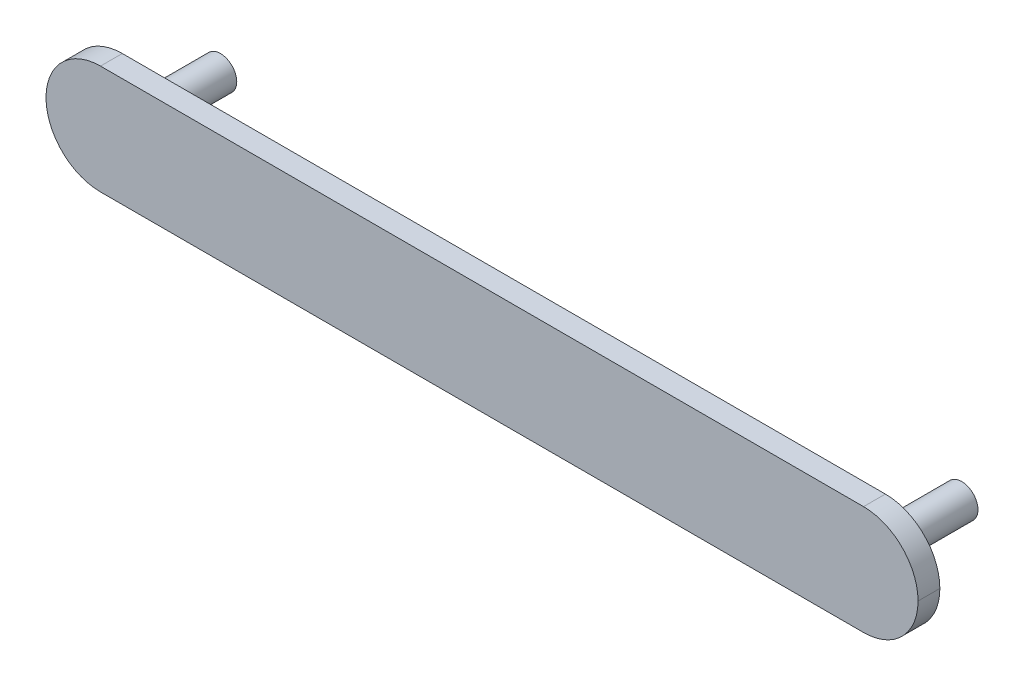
ISO-10303-21;
HEADER;
FILE_DESCRIPTION(('STEP AP214'),'2;1');
FILE_NAME('part.step','',(''),(''),'','','');
FILE_SCHEMA(('AUTOMOTIVE_DESIGN { 1 0 10303 214 1 1 1 1 }'));
ENDSEC;
DATA;
#1=APPLICATION_CONTEXT('core data for automotive mechanical design processes');
#2=APPLICATION_PROTOCOL_DEFINITION('international standard','automotive_design',2000,#1);
#3=PRODUCT_CONTEXT('',#1,'mechanical');
#4=PRODUCT('Part','Part','',(#3));
#5=PRODUCT_RELATED_PRODUCT_CATEGORY('part','',(#4));
#6=PRODUCT_DEFINITION_FORMATION('','',#4);
#7=PRODUCT_DEFINITION_CONTEXT('part definition',#1,'design');
#8=PRODUCT_DEFINITION('design','',#6,#7);
#9=PRODUCT_DEFINITION_SHAPE('','',#8);
#10=(LENGTH_UNIT() NAMED_UNIT(*) SI_UNIT(.MILLI.,.METRE.));
#11=(NAMED_UNIT(*) PLANE_ANGLE_UNIT() SI_UNIT($,.RADIAN.));
#12=(NAMED_UNIT(*) SI_UNIT($,.STERADIAN.) SOLID_ANGLE_UNIT());
#13=UNCERTAINTY_MEASURE_WITH_UNIT(LENGTH_MEASURE(1.E-05),#10,'distance_accuracy_value','');
#14=(GEOMETRIC_REPRESENTATION_CONTEXT(3) GLOBAL_UNCERTAINTY_ASSIGNED_CONTEXT((#13)) GLOBAL_UNIT_ASSIGNED_CONTEXT((#10,
#11,#12)) REPRESENTATION_CONTEXT('',''));
#15=CARTESIAN_POINT('',(0.,0.,0.));
#16=DIRECTION('',(0.,0.,1.));
#17=DIRECTION('',(1.,0.,0.));
#18=AXIS2_PLACEMENT_3D('',#15,#16,#17);
#19=CARTESIAN_POINT('',(0.,-5.,2.));
#20=DIRECTION('',(0.,-1.,0.));
#21=DIRECTION('',(1.,0.,0.));
#22=AXIS2_PLACEMENT_3D('',#19,#20,#21);
#23=PLANE('',#22);
#24=DIRECTION('',(-1.,0.,0.));
#25=VECTOR('',#24,1.);
#26=CARTESIAN_POINT('',(0.,-5.,2.));
#27=LINE('',#26,#25);
#28=CARTESIAN_POINT('',(35.,-5.,2.));
#29=VERTEX_POINT('',#28);
#30=CARTESIAN_POINT('',(-35.,-5.,2.));
#31=VERTEX_POINT('',#30);
#32=EDGE_CURVE('E147',#29,#31,#27,.T.);
#33=ORIENTED_EDGE('',*,*,#32,.T.);
#34=DIRECTION('',(0.,0.,-1.));
#35=VECTOR('',#34,1.);
#36=CARTESIAN_POINT('',(-35.,-5.,2.));
#37=LINE('',#36,#35);
#38=CARTESIAN_POINT('',(-35.,-5.,0.));
#39=VERTEX_POINT('',#38);
#40=EDGE_CURVE('E11',#31,#39,#37,.T.);
#41=ORIENTED_EDGE('',*,*,#40,.T.);
#42=DIRECTION('',(-1.,0.,0.));
#43=VECTOR('',#42,1.);
#44=CARTESIAN_POINT('',(0.,-5.,0.));
#45=LINE('',#44,#43);
#46=CARTESIAN_POINT('',(35.,-5.,0.));
#47=VERTEX_POINT('',#46);
#48=EDGE_CURVE('E108',#47,#39,#45,.T.);
#49=ORIENTED_EDGE('',*,*,#48,.F.);
#50=DIRECTION('',(0.,0.,-1.));
#51=VECTOR('',#50,1.);
#52=CARTESIAN_POINT('',(35.,-5.,2.));
#53=LINE('',#52,#51);
#54=EDGE_CURVE('E55',#47,#29,#53,.F.);
#55=ORIENTED_EDGE('',*,*,#54,.T.);
#56=EDGE_LOOP('',(#33,#41,#49,#55));
#57=FACE_BOUND('',#56,.T.);
#58=ADVANCED_FACE('F45',(#57),#23,.T.);
#59=CARTESIAN_POINT('',(0.,5.,2.));
#60=DIRECTION('',(0.,-1.,0.));
#61=DIRECTION('',(0.,0.,-1.));
#62=AXIS2_PLACEMENT_3D('',#59,#60,#61);
#63=PLANE('',#62);
#64=DIRECTION('',(-1.,0.,0.));
#65=VECTOR('',#64,1.);
#66=CARTESIAN_POINT('',(0.,5.,0.));
#67=LINE('',#66,#65);
#68=CARTESIAN_POINT('',(35.,5.,0.));
#69=VERTEX_POINT('',#68);
#70=CARTESIAN_POINT('',(-35.,5.,0.));
#71=VERTEX_POINT('',#70);
#72=EDGE_CURVE('E154',#69,#71,#67,.T.);
#73=ORIENTED_EDGE('',*,*,#72,.T.);
#74=DIRECTION('',(0.,0.,-1.));
#75=VECTOR('',#74,1.);
#76=CARTESIAN_POINT('',(-35.,5.,2.));
#77=LINE('',#76,#75);
#78=CARTESIAN_POINT('',(-35.,5.,2.));
#79=VERTEX_POINT('',#78);
#80=EDGE_CURVE('E123',#71,#79,#77,.F.);
#81=ORIENTED_EDGE('',*,*,#80,.T.);
#82=DIRECTION('',(-1.,0.,0.));
#83=VECTOR('',#82,1.);
#84=CARTESIAN_POINT('',(0.,5.,2.));
#85=LINE('',#84,#83);
#86=CARTESIAN_POINT('',(35.,5.,2.));
#87=VERTEX_POINT('',#86);
#88=EDGE_CURVE('E153',#87,#79,#85,.T.);
#89=ORIENTED_EDGE('',*,*,#88,.F.);
#90=DIRECTION('',(0.,0.,-1.));
#91=VECTOR('',#90,1.);
#92=CARTESIAN_POINT('',(35.,5.,2.));
#93=LINE('',#92,#91);
#94=EDGE_CURVE('E125',#87,#69,#93,.T.);
#95=ORIENTED_EDGE('',*,*,#94,.T.);
#96=EDGE_LOOP('',(#73,#81,#89,#95));
#97=FACE_BOUND('',#96,.T.);
#98=ADVANCED_FACE('F165',(#97),#63,.F.);
#99=CARTESIAN_POINT('',(0.,0.,2.));
#100=DIRECTION('',(0.,0.,1.));
#101=DIRECTION('',(1.,0.,0.));
#102=AXIS2_PLACEMENT_3D('',#99,#100,#101);
#103=PLANE('',#102);
#104=ORIENTED_EDGE('',*,*,#88,.T.);
#105=CARTESIAN_POINT('',(-35.,0.,2.));
#106=DIRECTION('',(0.,0.,1.));
#107=DIRECTION('',(1.,0.,0.));
#108=AXIS2_PLACEMENT_3D('',#105,#106,#107);
#109=CIRCLE('',#108,5.);
#110=CARTESIAN_POINT('',(-40.,0.,2.));
#111=VERTEX_POINT('',#110);
#112=EDGE_CURVE('E141',#79,#111,#109,.T.);
#113=ORIENTED_EDGE('',*,*,#112,.T.);
#114=CARTESIAN_POINT('',(-35.,0.,2.));
#115=DIRECTION('',(0.,0.,1.));
#116=DIRECTION('',(1.,0.,0.));
#117=AXIS2_PLACEMENT_3D('',#114,#115,#116);
#118=CIRCLE('',#117,5.);
#119=EDGE_CURVE('E69',#111,#31,#118,.T.);
#120=ORIENTED_EDGE('',*,*,#119,.T.);
#121=ORIENTED_EDGE('',*,*,#32,.F.);
#122=CARTESIAN_POINT('',(35.,0.,2.));
#123=DIRECTION('',(0.,0.,1.));
#124=DIRECTION('',(1.,0.,0.));
#125=AXIS2_PLACEMENT_3D('',#122,#123,#124);
#126=CIRCLE('',#125,5.);
#127=CARTESIAN_POINT('',(40.,0.,2.));
#128=VERTEX_POINT('',#127);
#129=EDGE_CURVE('E63',#29,#128,#126,.T.);
#130=ORIENTED_EDGE('',*,*,#129,.T.);
#131=CARTESIAN_POINT('',(35.,0.,2.));
#132=DIRECTION('',(0.,0.,1.));
#133=DIRECTION('',(1.,0.,0.));
#134=AXIS2_PLACEMENT_3D('',#131,#132,#133);
#135=CIRCLE('',#134,5.);
#136=EDGE_CURVE('E136',#128,#87,#135,.T.);
#137=ORIENTED_EDGE('',*,*,#136,.T.);
#138=EDGE_LOOP('',(#104,#113,#120,#121,#130,#137));
#139=FACE_BOUND('',#138,.T.);
#140=ADVANCED_FACE('F151',(#139),#103,.T.);
#141=CARTESIAN_POINT('',(0.,0.,0.));
#142=DIRECTION('',(0.,0.,1.));
#143=DIRECTION('',(1.,0.,0.));
#144=AXIS2_PLACEMENT_3D('',#141,#142,#143);
#145=PLANE('',#144);
#146=CARTESIAN_POINT('',(-34.,0.,0.));
#147=DIRECTION('',(0.,0.,1.));
#148=DIRECTION('',(1.,0.,0.));
#149=AXIS2_PLACEMENT_3D('',#146,#147,#148);
#150=CIRCLE('',#149,1.5);
#151=CARTESIAN_POINT('',(-32.5,0.,0.));
#152=VERTEX_POINT('',#151);
#153=EDGE_CURVE('E180',#152,#152,#150,.T.);
#154=ORIENTED_EDGE('',*,*,#153,.T.);
#155=EDGE_LOOP('',(#154));
#156=FACE_BOUND('',#155,.T.);
#157=CARTESIAN_POINT('',(34.,0.,0.));
#158=DIRECTION('',(0.,0.,1.));
#159=DIRECTION('',(1.,0.,0.));
#160=AXIS2_PLACEMENT_3D('',#157,#158,#159);
#161=CIRCLE('',#160,1.5);
#162=CARTESIAN_POINT('',(35.5,0.,0.));
#163=VERTEX_POINT('',#162);
#164=EDGE_CURVE('E184',#163,#163,#161,.T.);
#165=ORIENTED_EDGE('',*,*,#164,.T.);
#166=EDGE_LOOP('',(#165));
#167=FACE_BOUND('',#166,.T.);
#168=CARTESIAN_POINT('',(-35.,0.,0.));
#169=DIRECTION('',(0.,0.,1.));
#170=DIRECTION('',(1.,0.,0.));
#171=AXIS2_PLACEMENT_3D('',#168,#169,#170);
#172=CIRCLE('',#171,5.);
#173=CARTESIAN_POINT('',(-40.,0.,0.));
#174=VERTEX_POINT('',#173);
#175=EDGE_CURVE('E100',#39,#174,#172,.F.);
#176=ORIENTED_EDGE('',*,*,#175,.T.);
#177=CARTESIAN_POINT('',(-35.,0.,0.));
#178=DIRECTION('',(0.,0.,1.));
#179=DIRECTION('',(1.,0.,0.));
#180=AXIS2_PLACEMENT_3D('',#177,#178,#179);
#181=CIRCLE('',#180,5.);
#182=EDGE_CURVE('E105',#174,#71,#181,.F.);
#183=ORIENTED_EDGE('',*,*,#182,.T.);
#184=ORIENTED_EDGE('',*,*,#72,.F.);
#185=CARTESIAN_POINT('',(35.,0.,0.));
#186=DIRECTION('',(0.,0.,1.));
#187=DIRECTION('',(1.,0.,0.));
#188=AXIS2_PLACEMENT_3D('',#185,#186,#187);
#189=CIRCLE('',#188,5.);
#190=CARTESIAN_POINT('',(40.,0.,0.));
#191=VERTEX_POINT('',#190);
#192=EDGE_CURVE('E112',#69,#191,#189,.F.);
#193=ORIENTED_EDGE('',*,*,#192,.T.);
#194=CARTESIAN_POINT('',(35.,0.,0.));
#195=DIRECTION('',(0.,0.,1.));
#196=DIRECTION('',(1.,0.,0.));
#197=AXIS2_PLACEMENT_3D('',#194,#195,#196);
#198=CIRCLE('',#197,5.);
#199=EDGE_CURVE('E158',#191,#47,#198,.F.);
#200=ORIENTED_EDGE('',*,*,#199,.T.);
#201=ORIENTED_EDGE('',*,*,#48,.T.);
#202=EDGE_LOOP('',(#176,#183,#184,#193,#200,#201));
#203=FACE_BOUND('',#202,.T.);
#204=ADVANCED_FACE('F102',(#156,#167,#203),#145,.F.);
#205=CARTESIAN_POINT('',(34.,0.,-8.));
#206=DIRECTION('',(0.,0.,1.));
#207=DIRECTION('',(1.,0.,0.));
#208=AXIS2_PLACEMENT_3D('',#205,#206,#207);
#209=CYLINDRICAL_SURFACE('',#208,1.5);
#210=CARTESIAN_POINT('',(34.,0.,-8.));
#211=DIRECTION('',(0.,0.,1.));
#212=DIRECTION('',(1.,0.,0.));
#213=AXIS2_PLACEMENT_3D('',#210,#211,#212);
#214=CIRCLE('',#213,1.5);
#215=CARTESIAN_POINT('',(35.5,0.,-8.));
#216=VERTEX_POINT('',#215);
#217=EDGE_CURVE('E119',#216,#216,#214,.T.);
#218=ORIENTED_EDGE('',*,*,#217,.T.);
#219=EDGE_LOOP('',(#218));
#220=FACE_BOUND('',#219,.T.);
#221=ORIENTED_EDGE('',*,*,#164,.F.);
#222=EDGE_LOOP('',(#221));
#223=FACE_BOUND('',#222,.T.);
#224=ADVANCED_FACE('F192',(#220,#223),#209,.T.);
#225=CARTESIAN_POINT('',(34.,0.,-8.));
#226=DIRECTION('',(0.,0.,1.));
#227=DIRECTION('',(1.,0.,0.));
#228=AXIS2_PLACEMENT_3D('',#225,#226,#227);
#229=PLANE('',#228);
#230=ORIENTED_EDGE('',*,*,#217,.F.);
#231=EDGE_LOOP('',(#230));
#232=FACE_BOUND('',#231,.T.);
#233=ADVANCED_FACE('F195',(#232),#229,.F.);
#234=CARTESIAN_POINT('',(-34.,0.,-8.));
#235=DIRECTION('',(0.,0.,1.));
#236=DIRECTION('',(1.,0.,0.));
#237=AXIS2_PLACEMENT_3D('',#234,#235,#236);
#238=CYLINDRICAL_SURFACE('',#237,1.5);
#239=CARTESIAN_POINT('',(-34.,0.,-8.));
#240=DIRECTION('',(0.,0.,1.));
#241=DIRECTION('',(1.,0.,0.));
#242=AXIS2_PLACEMENT_3D('',#239,#240,#241);
#243=CIRCLE('',#242,1.5);
#244=CARTESIAN_POINT('',(-32.5,0.,-8.));
#245=VERTEX_POINT('',#244);
#246=EDGE_CURVE('E174',#245,#245,#243,.T.);
#247=ORIENTED_EDGE('',*,*,#246,.T.);
#248=EDGE_LOOP('',(#247));
#249=FACE_BOUND('',#248,.T.);
#250=ORIENTED_EDGE('',*,*,#153,.F.);
#251=EDGE_LOOP('',(#250));
#252=FACE_BOUND('',#251,.T.);
#253=ADVANCED_FACE('F197',(#249,#252),#238,.T.);
#254=CARTESIAN_POINT('',(-34.,0.,-8.));
#255=DIRECTION('',(0.,0.,1.));
#256=DIRECTION('',(1.,0.,0.));
#257=AXIS2_PLACEMENT_3D('',#254,#255,#256);
#258=PLANE('',#257);
#259=ORIENTED_EDGE('',*,*,#246,.F.);
#260=EDGE_LOOP('',(#259));
#261=FACE_BOUND('',#260,.T.);
#262=ADVANCED_FACE('F203',(#261),#258,.F.);
#263=CARTESIAN_POINT('',(-35.,0.,2.));
#264=DIRECTION('',(0.,0.,-1.));
#265=DIRECTION('',(-1.,0.,0.));
#266=AXIS2_PLACEMENT_3D('',#263,#264,#265);
#267=CYLINDRICAL_SURFACE('',#266,5.);
#268=ORIENTED_EDGE('',*,*,#40,.F.);
#269=ORIENTED_EDGE('',*,*,#119,.F.);
#270=DIRECTION('',(0.,0.,-1.));
#271=VECTOR('',#270,1.);
#272=CARTESIAN_POINT('',(-40.,0.,2.));
#273=LINE('',#272,#271);
#274=EDGE_CURVE('E115',#174,#111,#273,.F.);
#275=ORIENTED_EDGE('',*,*,#274,.F.);
#276=ORIENTED_EDGE('',*,*,#175,.F.);
#277=EDGE_LOOP('',(#268,#269,#275,#276));
#278=FACE_BOUND('',#277,.T.);
#279=ADVANCED_FACE('F116',(#278),#267,.T.);
#280=CARTESIAN_POINT('',(-35.,0.,2.));
#281=DIRECTION('',(0.,0.,1.));
#282=DIRECTION('',(1.,0.,0.));
#283=AXIS2_PLACEMENT_3D('',#280,#281,#282);
#284=CYLINDRICAL_SURFACE('',#283,5.);
#285=ORIENTED_EDGE('',*,*,#112,.F.);
#286=ORIENTED_EDGE('',*,*,#80,.F.);
#287=ORIENTED_EDGE('',*,*,#182,.F.);
#288=ORIENTED_EDGE('',*,*,#274,.T.);
#289=EDGE_LOOP('',(#285,#286,#287,#288));
#290=FACE_BOUND('',#289,.T.);
#291=ADVANCED_FACE('F121',(#290),#284,.T.);
#292=CARTESIAN_POINT('',(35.,0.,2.));
#293=DIRECTION('',(0.,0.,1.));
#294=DIRECTION('',(1.,0.,0.));
#295=AXIS2_PLACEMENT_3D('',#292,#293,#294);
#296=CYLINDRICAL_SURFACE('',#295,5.);
#297=DIRECTION('',(0.,0.,-1.));
#298=VECTOR('',#297,1.);
#299=CARTESIAN_POINT('',(40.,0.,0.));
#300=LINE('',#299,#298);
#301=EDGE_CURVE('E49',#128,#191,#300,.T.);
#302=ORIENTED_EDGE('',*,*,#301,.F.);
#303=ORIENTED_EDGE('',*,*,#129,.F.);
#304=ORIENTED_EDGE('',*,*,#54,.F.);
#305=ORIENTED_EDGE('',*,*,#199,.F.);
#306=EDGE_LOOP('',(#302,#303,#304,#305));
#307=FACE_BOUND('',#306,.T.);
#308=ADVANCED_FACE('F47',(#307),#296,.T.);
#309=CARTESIAN_POINT('',(35.,0.,2.));
#310=DIRECTION('',(0.,0.,-1.));
#311=DIRECTION('',(-1.,0.,0.));
#312=AXIS2_PLACEMENT_3D('',#309,#310,#311);
#313=CYLINDRICAL_SURFACE('',#312,5.);
#314=ORIENTED_EDGE('',*,*,#136,.F.);
#315=ORIENTED_EDGE('',*,*,#301,.T.);
#316=ORIENTED_EDGE('',*,*,#192,.F.);
#317=ORIENTED_EDGE('',*,*,#94,.F.);
#318=EDGE_LOOP('',(#314,#315,#316,#317));
#319=FACE_BOUND('',#318,.T.);
#320=ADVANCED_FACE('F162',(#319),#313,.T.);
#321=CLOSED_SHELL('',(#58,#98,#140,#204,#224,#233,#253,#262,#279,#291,#308,#320));
#322=MANIFOLD_SOLID_BREP('B2',#321);
#323=ADVANCED_BREP_SHAPE_REPRESENTATION('',(#18,#322),#14);
#324=SHAPE_DEFINITION_REPRESENTATION(#9,#323);
ENDSEC;
END-ISO-10303-21;
